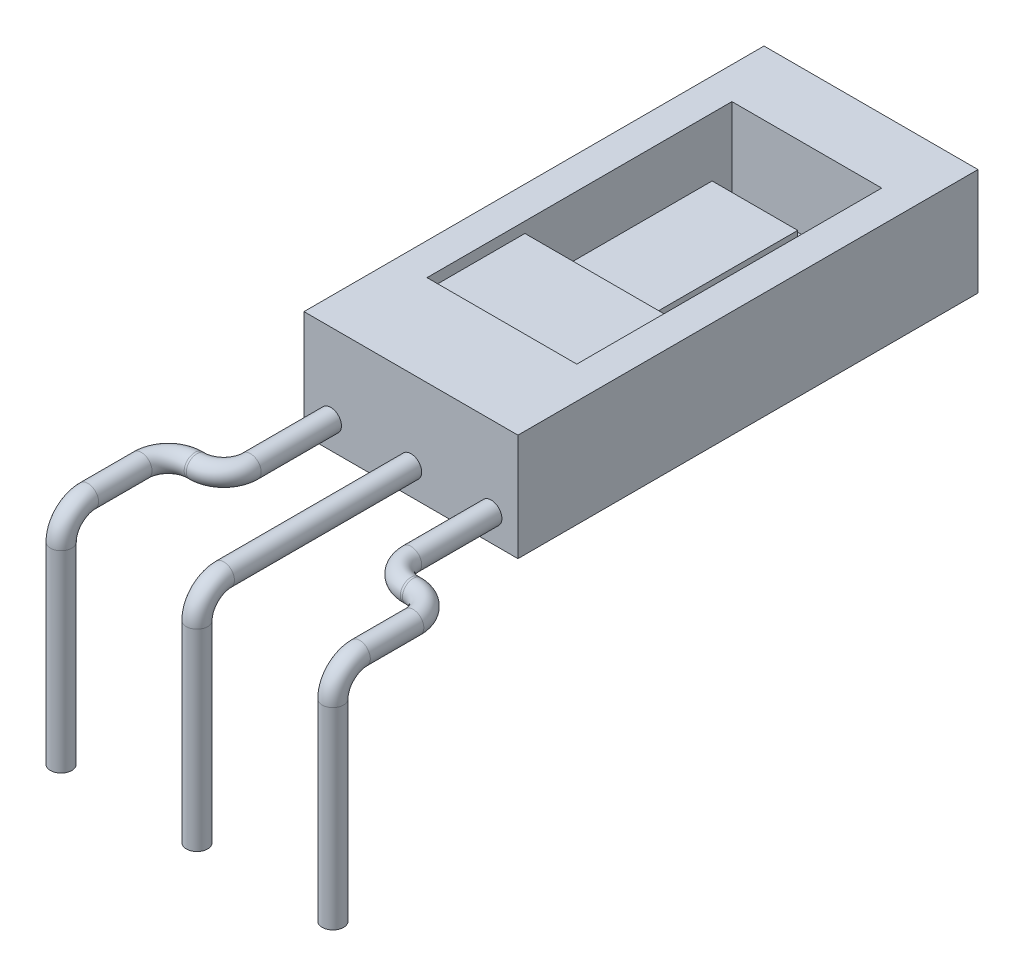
ISO-10303-21;
HEADER;
FILE_DESCRIPTION(('STEP AP214'),'2;1');
FILE_NAME('part.step','',(''),(''),'','','');
FILE_SCHEMA(('AUTOMOTIVE_DESIGN { 1 0 10303 214 1 1 1 1 }'));
ENDSEC;
DATA;
#1=APPLICATION_CONTEXT('core data for automotive mechanical design processes');
#2=APPLICATION_PROTOCOL_DEFINITION('international standard','automotive_design',2000,#1);
#3=PRODUCT_CONTEXT('',#1,'mechanical');
#4=PRODUCT('Part','Part','',(#3));
#5=PRODUCT_RELATED_PRODUCT_CATEGORY('part','',(#4));
#6=PRODUCT_DEFINITION_FORMATION('','',#4);
#7=PRODUCT_DEFINITION_CONTEXT('part definition',#1,'design');
#8=PRODUCT_DEFINITION('design','',#6,#7);
#9=PRODUCT_DEFINITION_SHAPE('','',#8);
#10=(LENGTH_UNIT() NAMED_UNIT(*) SI_UNIT(.MILLI.,.METRE.));
#11=(NAMED_UNIT(*) PLANE_ANGLE_UNIT() SI_UNIT($,.RADIAN.));
#12=(NAMED_UNIT(*) SI_UNIT($,.STERADIAN.) SOLID_ANGLE_UNIT());
#13=UNCERTAINTY_MEASURE_WITH_UNIT(LENGTH_MEASURE(1.E-05),#10,'distance_accuracy_value','');
#14=(GEOMETRIC_REPRESENTATION_CONTEXT(3) GLOBAL_UNCERTAINTY_ASSIGNED_CONTEXT((#13)) GLOBAL_UNIT_ASSIGNED_CONTEXT((#10,
#11,#12)) REPRESENTATION_CONTEXT('',''));
#15=CARTESIAN_POINT('',(0.,0.,0.));
#16=DIRECTION('',(0.,0.,1.));
#17=DIRECTION('',(1.,0.,0.));
#18=AXIS2_PLACEMENT_3D('',#15,#16,#17);
#19=CARTESIAN_POINT('',(-2.,2.,0.));
#20=DIRECTION('',(0.,0.,-1.));
#21=DIRECTION('',(-1.,0.,0.));
#22=AXIS2_PLACEMENT_3D('',#19,#20,#21);
#23=PLANE('',#22);
#24=CARTESIAN_POINT('',(1.5,0.5,0.));
#25=DIRECTION('',(0.,0.,-1.));
#26=DIRECTION('',(-1.,0.,0.));
#27=AXIS2_PLACEMENT_3D('',#24,#25,#26);
#28=CIRCLE('',#27,0.2);
#29=CARTESIAN_POINT('',(1.3,0.5,0.));
#30=VERTEX_POINT('',#29);
#31=EDGE_CURVE('E291',#30,#30,#28,.T.);
#32=ORIENTED_EDGE('',*,*,#31,.T.);
#33=EDGE_LOOP('',(#32));
#34=FACE_BOUND('',#33,.T.);
#35=CARTESIAN_POINT('',(0.,0.5,0.));
#36=DIRECTION('',(0.,0.,1.));
#37=DIRECTION('',(1.,0.,0.));
#38=AXIS2_PLACEMENT_3D('',#35,#36,#37);
#39=CIRCLE('',#38,0.2);
#40=CARTESIAN_POINT('',(0.2,0.5,0.));
#41=VERTEX_POINT('',#40);
#42=EDGE_CURVE('E36',#41,#41,#39,.T.);
#43=ORIENTED_EDGE('',*,*,#42,.F.);
#44=EDGE_LOOP('',(#43));
#45=FACE_BOUND('',#44,.T.);
#46=DIRECTION('',(1.,0.,0.));
#47=VECTOR('',#46,1.);
#48=CARTESIAN_POINT('',(-2.,0.,0.));
#49=LINE('',#48,#47);
#50=CARTESIAN_POINT('',(-2.,0.,0.));
#51=VERTEX_POINT('',#50);
#52=CARTESIAN_POINT('',(2.,0.,0.));
#53=VERTEX_POINT('',#52);
#54=EDGE_CURVE('E185',#51,#53,#49,.T.);
#55=ORIENTED_EDGE('',*,*,#54,.T.);
#56=DIRECTION('',(0.,-1.,0.));
#57=VECTOR('',#56,1.);
#58=CARTESIAN_POINT('',(2.,2.,0.));
#59=LINE('',#58,#57);
#60=CARTESIAN_POINT('',(2.,2.,0.));
#61=VERTEX_POINT('',#60);
#62=EDGE_CURVE('E159',#61,#53,#59,.T.);
#63=ORIENTED_EDGE('',*,*,#62,.F.);
#64=DIRECTION('',(1.,0.,0.));
#65=VECTOR('',#64,1.);
#66=CARTESIAN_POINT('',(-2.,2.,0.));
#67=LINE('',#66,#65);
#68=CARTESIAN_POINT('',(-2.,2.,0.));
#69=VERTEX_POINT('',#68);
#70=EDGE_CURVE('E176',#69,#61,#67,.T.);
#71=ORIENTED_EDGE('',*,*,#70,.F.);
#72=DIRECTION('',(0.,-1.,0.));
#73=VECTOR('',#72,1.);
#74=CARTESIAN_POINT('',(-2.,2.,0.));
#75=LINE('',#74,#73);
#76=EDGE_CURVE('E157',#69,#51,#75,.T.);
#77=ORIENTED_EDGE('',*,*,#76,.T.);
#78=EDGE_LOOP('',(#55,#63,#71,#77));
#79=FACE_BOUND('',#78,.T.);
#80=CARTESIAN_POINT('',(-1.5,0.5,0.));
#81=DIRECTION('',(0.,0.,1.));
#82=DIRECTION('',(1.,0.,0.));
#83=AXIS2_PLACEMENT_3D('',#80,#81,#82);
#84=CIRCLE('',#83,0.2);
#85=CARTESIAN_POINT('',(-1.3,0.5,0.));
#86=VERTEX_POINT('',#85);
#87=EDGE_CURVE('E11',#86,#86,#84,.T.);
#88=ORIENTED_EDGE('',*,*,#87,.F.);
#89=EDGE_LOOP('',(#88));
#90=FACE_BOUND('',#89,.T.);
#91=ADVANCED_FACE('F27',(#34,#45,#79,#90),#23,.F.);
#92=CARTESIAN_POINT('',(-1.4,0.5,-1.7));
#93=DIRECTION('',(0.,1.,0.));
#94=DIRECTION('',(0.,0.,1.));
#95=AXIS2_PLACEMENT_3D('',#92,#93,#94);
#96=PLANE('',#95);
#97=DIRECTION('',(1.,0.,0.));
#98=VECTOR('',#97,1.);
#99=CARTESIAN_POINT('',(-1.4,0.5,-3.53));
#100=LINE('',#99,#98);
#101=CARTESIAN_POINT('',(-1.4,0.5,-3.53));
#102=VERTEX_POINT('',#101);
#103=CARTESIAN_POINT('',(-0.8,0.5,-3.53));
#104=VERTEX_POINT('',#103);
#105=EDGE_CURVE('E31',#102,#104,#100,.T.);
#106=ORIENTED_EDGE('',*,*,#105,.T.);
#107=DIRECTION('',(0.,0.,1.));
#108=VECTOR('',#107,1.);
#109=CARTESIAN_POINT('',(-0.8,0.5,-6.43));
#110=LINE('',#109,#108);
#111=CARTESIAN_POINT('',(-0.8,0.5,-6.43));
#112=VERTEX_POINT('',#111);
#113=EDGE_CURVE('E131',#112,#104,#110,.T.);
#114=ORIENTED_EDGE('',*,*,#113,.F.);
#115=DIRECTION('',(-1.,0.,0.));
#116=VECTOR('',#115,1.);
#117=CARTESIAN_POINT('',(-0.8,0.5,-6.43));
#118=LINE('',#117,#116);
#119=CARTESIAN_POINT('',(0.800000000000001,0.5,-6.43));
#120=VERTEX_POINT('',#119);
#121=EDGE_CURVE('E238',#120,#112,#118,.T.);
#122=ORIENTED_EDGE('',*,*,#121,.F.);
#123=DIRECTION('',(0.,0.,-1.));
#124=VECTOR('',#123,1.);
#125=CARTESIAN_POINT('',(0.800000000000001,0.5,-6.43));
#126=LINE('',#125,#124);
#127=CARTESIAN_POINT('',(0.800000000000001,0.5,-3.53));
#128=VERTEX_POINT('',#127);
#129=EDGE_CURVE('E137',#128,#120,#126,.T.);
#130=ORIENTED_EDGE('',*,*,#129,.F.);
#131=CARTESIAN_POINT('',(1.4,0.5,-3.53));
#132=VERTEX_POINT('',#131);
#133=EDGE_CURVE('E52',#128,#132,#100,.T.);
#134=ORIENTED_EDGE('',*,*,#133,.T.);
#135=DIRECTION('',(0.,0.,-1.));
#136=VECTOR('',#135,1.);
#137=CARTESIAN_POINT('',(1.4,0.5,-7.4));
#138=LINE('',#137,#136);
#139=CARTESIAN_POINT('',(1.4,0.5,-7.4));
#140=VERTEX_POINT('',#139);
#141=EDGE_CURVE('E199',#132,#140,#138,.T.);
#142=ORIENTED_EDGE('',*,*,#141,.T.);
#143=DIRECTION('',(-1.,0.,0.));
#144=VECTOR('',#143,1.);
#145=CARTESIAN_POINT('',(-1.4,0.5,-7.4));
#146=LINE('',#145,#144);
#147=CARTESIAN_POINT('',(-1.4,0.5,-7.4));
#148=VERTEX_POINT('',#147);
#149=EDGE_CURVE('E193',#140,#148,#146,.T.);
#150=ORIENTED_EDGE('',*,*,#149,.T.);
#151=DIRECTION('',(0.,0.,1.));
#152=VECTOR('',#151,1.);
#153=CARTESIAN_POINT('',(-1.4,0.5,-7.4));
#154=LINE('',#153,#152);
#155=EDGE_CURVE('E154',#148,#102,#154,.T.);
#156=ORIENTED_EDGE('',*,*,#155,.T.);
#157=EDGE_LOOP('',(#106,#114,#122,#130,#134,#142,#150,#156));
#158=FACE_BOUND('',#157,.T.);
#159=ADVANCED_FACE('F151',(#158),#96,.T.);
#160=CARTESIAN_POINT('',(-1.4,1.8,-3.53));
#161=DIRECTION('',(0.,0.,1.));
#162=DIRECTION('',(1.,0.,0.));
#163=AXIS2_PLACEMENT_3D('',#160,#161,#162);
#164=PLANE('',#163);
#165=DIRECTION('',(0.,-1.,0.));
#166=VECTOR('',#165,1.);
#167=CARTESIAN_POINT('',(-0.8,1.5,-3.53));
#168=LINE('',#167,#166);
#169=CARTESIAN_POINT('',(-0.8,1.5,-3.53));
#170=VERTEX_POINT('',#169);
#171=EDGE_CURVE('E44',#170,#104,#168,.T.);
#172=ORIENTED_EDGE('',*,*,#171,.T.);
#173=ORIENTED_EDGE('',*,*,#105,.F.);
#174=DIRECTION('',(0.,-1.,0.));
#175=VECTOR('',#174,1.);
#176=CARTESIAN_POINT('',(-1.4,1.8,-3.53));
#177=LINE('',#176,#175);
#178=CARTESIAN_POINT('',(-1.4,1.8,-3.53));
#179=VERTEX_POINT('',#178);
#180=EDGE_CURVE('E219',#179,#102,#177,.T.);
#181=ORIENTED_EDGE('',*,*,#180,.F.);
#182=DIRECTION('',(-1.,0.,0.));
#183=VECTOR('',#182,1.);
#184=CARTESIAN_POINT('',(-1.4,1.8,-3.53));
#185=LINE('',#184,#183);
#186=CARTESIAN_POINT('',(1.4,1.8,-3.53));
#187=VERTEX_POINT('',#186);
#188=EDGE_CURVE('E221',#187,#179,#185,.T.);
#189=ORIENTED_EDGE('',*,*,#188,.F.);
#190=DIRECTION('',(0.,-1.,0.));
#191=VECTOR('',#190,1.);
#192=CARTESIAN_POINT('',(1.4,0.5,-3.53));
#193=LINE('',#192,#191);
#194=EDGE_CURVE('E217',#187,#132,#193,.T.);
#195=ORIENTED_EDGE('',*,*,#194,.T.);
#196=ORIENTED_EDGE('',*,*,#133,.F.);
#197=DIRECTION('',(0.,-1.,0.));
#198=VECTOR('',#197,1.);
#199=CARTESIAN_POINT('',(0.800000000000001,1.5,-3.53));
#200=LINE('',#199,#198);
#201=CARTESIAN_POINT('',(0.800000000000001,1.5,-3.53));
#202=VERTEX_POINT('',#201);
#203=EDGE_CURVE('E148',#202,#128,#200,.T.);
#204=ORIENTED_EDGE('',*,*,#203,.F.);
#205=DIRECTION('',(1.,0.,0.));
#206=VECTOR('',#205,1.);
#207=CARTESIAN_POINT('',(-0.8,1.5,-3.53));
#208=LINE('',#207,#206);
#209=EDGE_CURVE('E146',#170,#202,#208,.T.);
#210=ORIENTED_EDGE('',*,*,#209,.F.);
#211=EDGE_LOOP('',(#172,#173,#181,#189,#195,#196,#204,#210));
#212=FACE_BOUND('',#211,.T.);
#213=ADVANCED_FACE('F142',(#212),#164,.F.);
#214=CARTESIAN_POINT('',(-1.4,0.5,-7.4));
#215=DIRECTION('',(-1.,0.,0.));
#216=DIRECTION('',(0.,0.,1.));
#217=AXIS2_PLACEMENT_3D('',#214,#215,#216);
#218=PLANE('',#217);
#219=ORIENTED_EDGE('',*,*,#180,.T.);
#220=ORIENTED_EDGE('',*,*,#155,.F.);
#221=DIRECTION('',(0.,1.,0.));
#222=VECTOR('',#221,1.);
#223=CARTESIAN_POINT('',(-1.4,0.5,-7.4));
#224=LINE('',#223,#222);
#225=CARTESIAN_POINT('',(-1.4,2.,-7.4));
#226=VERTEX_POINT('',#225);
#227=EDGE_CURVE('E189',#148,#226,#224,.T.);
#228=ORIENTED_EDGE('',*,*,#227,.T.);
#229=DIRECTION('',(0.,0.,1.));
#230=VECTOR('',#229,1.);
#231=CARTESIAN_POINT('',(-1.4,2.,-7.4));
#232=LINE('',#231,#230);
#233=CARTESIAN_POINT('',(-1.4,2.,-1.7));
#234=VERTEX_POINT('',#233);
#235=EDGE_CURVE('E211',#226,#234,#232,.T.);
#236=ORIENTED_EDGE('',*,*,#235,.T.);
#237=DIRECTION('',(0.,1.,0.));
#238=VECTOR('',#237,1.);
#239=CARTESIAN_POINT('',(-1.4,0.5,-1.7));
#240=LINE('',#239,#238);
#241=CARTESIAN_POINT('',(-1.4,1.8,-1.7));
#242=VERTEX_POINT('',#241);
#243=EDGE_CURVE('E190',#242,#234,#240,.T.);
#244=ORIENTED_EDGE('',*,*,#243,.F.);
#245=DIRECTION('',(0.,0.,1.));
#246=VECTOR('',#245,1.);
#247=CARTESIAN_POINT('',(-1.4,1.8,-3.53));
#248=LINE('',#247,#246);
#249=EDGE_CURVE('E147',#179,#242,#248,.T.);
#250=ORIENTED_EDGE('',*,*,#249,.F.);
#251=EDGE_LOOP('',(#219,#220,#228,#236,#244,#250));
#252=FACE_BOUND('',#251,.T.);
#253=ADVANCED_FACE('F337',(#252),#218,.F.);
#254=CARTESIAN_POINT('',(1.4,0.5,-7.4));
#255=DIRECTION('',(1.,0.,0.));
#256=DIRECTION('',(0.,0.,-1.));
#257=AXIS2_PLACEMENT_3D('',#254,#255,#256);
#258=PLANE('',#257);
#259=ORIENTED_EDGE('',*,*,#194,.F.);
#260=DIRECTION('',(0.,0.,1.));
#261=VECTOR('',#260,1.);
#262=CARTESIAN_POINT('',(1.4,1.8,-7.4));
#263=LINE('',#262,#261);
#264=CARTESIAN_POINT('',(1.4,1.8,-1.7));
#265=VERTEX_POINT('',#264);
#266=EDGE_CURVE('E214',#187,#265,#263,.T.);
#267=ORIENTED_EDGE('',*,*,#266,.T.);
#268=DIRECTION('',(0.,1.,0.));
#269=VECTOR('',#268,1.);
#270=CARTESIAN_POINT('',(1.4,0.5,-1.7));
#271=LINE('',#270,#269);
#272=CARTESIAN_POINT('',(1.4,2.,-1.7));
#273=VERTEX_POINT('',#272);
#274=EDGE_CURVE('E192',#265,#273,#271,.T.);
#275=ORIENTED_EDGE('',*,*,#274,.T.);
#276=DIRECTION('',(0.,0.,-1.));
#277=VECTOR('',#276,1.);
#278=CARTESIAN_POINT('',(1.4,2.,-7.4));
#279=LINE('',#278,#277);
#280=CARTESIAN_POINT('',(1.4,2.,-7.4));
#281=VERTEX_POINT('',#280);
#282=EDGE_CURVE('E205',#273,#281,#279,.T.);
#283=ORIENTED_EDGE('',*,*,#282,.T.);
#284=DIRECTION('',(0.,1.,0.));
#285=VECTOR('',#284,1.);
#286=CARTESIAN_POINT('',(1.4,0.5,-7.4));
#287=LINE('',#286,#285);
#288=EDGE_CURVE('E195',#140,#281,#287,.T.);
#289=ORIENTED_EDGE('',*,*,#288,.F.);
#290=ORIENTED_EDGE('',*,*,#141,.F.);
#291=EDGE_LOOP('',(#259,#267,#275,#283,#289,#290));
#292=FACE_BOUND('',#291,.T.);
#293=ADVANCED_FACE('F340',(#292),#258,.F.);
#294=CARTESIAN_POINT('',(-2.,2.,-8.6));
#295=DIRECTION('',(1.,0.,0.));
#296=DIRECTION('',(0.,0.,-1.));
#297=AXIS2_PLACEMENT_3D('',#294,#295,#296);
#298=PLANE('',#297);
#299=DIRECTION('',(0.,0.,1.));
#300=VECTOR('',#299,1.);
#301=CARTESIAN_POINT('',(-2.,0.,-8.6));
#302=LINE('',#301,#300);
#303=CARTESIAN_POINT('',(-2.,0.,-8.6));
#304=VERTEX_POINT('',#303);
#305=EDGE_CURVE('E187',#304,#51,#302,.T.);
#306=ORIENTED_EDGE('',*,*,#305,.T.);
#307=ORIENTED_EDGE('',*,*,#76,.F.);
#308=DIRECTION('',(0.,0.,1.));
#309=VECTOR('',#308,1.);
#310=CARTESIAN_POINT('',(-2.,2.,-8.6));
#311=LINE('',#310,#309);
#312=CARTESIAN_POINT('',(-2.,2.,-8.6));
#313=VERTEX_POINT('',#312);
#314=EDGE_CURVE('E178',#313,#69,#311,.T.);
#315=ORIENTED_EDGE('',*,*,#314,.F.);
#316=DIRECTION('',(0.,-1.,0.));
#317=VECTOR('',#316,1.);
#318=CARTESIAN_POINT('',(-2.,2.,-8.6));
#319=LINE('',#318,#317);
#320=EDGE_CURVE('E169',#313,#304,#319,.T.);
#321=ORIENTED_EDGE('',*,*,#320,.T.);
#322=EDGE_LOOP('',(#306,#307,#315,#321));
#323=FACE_BOUND('',#322,.T.);
#324=ADVANCED_FACE('F29',(#323),#298,.F.);
#325=CARTESIAN_POINT('',(2.,2.,-8.6));
#326=DIRECTION('',(-1.,0.,0.));
#327=DIRECTION('',(0.,0.,1.));
#328=AXIS2_PLACEMENT_3D('',#325,#326,#327);
#329=PLANE('',#328);
#330=DIRECTION('',(0.,0.,-1.));
#331=VECTOR('',#330,1.);
#332=CARTESIAN_POINT('',(2.,0.,-8.6));
#333=LINE('',#332,#331);
#334=CARTESIAN_POINT('',(2.,0.,-8.6));
#335=VERTEX_POINT('',#334);
#336=EDGE_CURVE('E183',#53,#335,#333,.T.);
#337=ORIENTED_EDGE('',*,*,#336,.T.);
#338=DIRECTION('',(0.,-1.,0.));
#339=VECTOR('',#338,1.);
#340=CARTESIAN_POINT('',(2.,2.,-8.6));
#341=LINE('',#340,#339);
#342=CARTESIAN_POINT('',(2.,2.,-8.6));
#343=VERTEX_POINT('',#342);
#344=EDGE_CURVE('E164',#343,#335,#341,.T.);
#345=ORIENTED_EDGE('',*,*,#344,.F.);
#346=DIRECTION('',(0.,0.,-1.));
#347=VECTOR('',#346,1.);
#348=CARTESIAN_POINT('',(2.,2.,-8.6));
#349=LINE('',#348,#347);
#350=EDGE_CURVE('E174',#61,#343,#349,.T.);
#351=ORIENTED_EDGE('',*,*,#350,.F.);
#352=ORIENTED_EDGE('',*,*,#62,.T.);
#353=EDGE_LOOP('',(#337,#345,#351,#352));
#354=FACE_BOUND('',#353,.T.);
#355=ADVANCED_FACE('F320',(#354),#329,.F.);
#356=CARTESIAN_POINT('',(-2.,2.,-8.6));
#357=DIRECTION('',(0.,0.,1.));
#358=DIRECTION('',(1.,0.,0.));
#359=AXIS2_PLACEMENT_3D('',#356,#357,#358);
#360=PLANE('',#359);
#361=DIRECTION('',(-1.,0.,0.));
#362=VECTOR('',#361,1.);
#363=CARTESIAN_POINT('',(-2.,0.,-8.6));
#364=LINE('',#363,#362);
#365=EDGE_CURVE('E181',#335,#304,#364,.T.);
#366=ORIENTED_EDGE('',*,*,#365,.T.);
#367=ORIENTED_EDGE('',*,*,#320,.F.);
#368=DIRECTION('',(-1.,0.,0.));
#369=VECTOR('',#368,1.);
#370=CARTESIAN_POINT('',(-2.,2.,-8.6));
#371=LINE('',#370,#369);
#372=EDGE_CURVE('E172',#343,#313,#371,.T.);
#373=ORIENTED_EDGE('',*,*,#372,.F.);
#374=ORIENTED_EDGE('',*,*,#344,.T.);
#375=EDGE_LOOP('',(#366,#367,#373,#374));
#376=FACE_BOUND('',#375,.T.);
#377=ADVANCED_FACE('F323',(#376),#360,.F.);
#378=CARTESIAN_POINT('',(-2.,2.,0.));
#379=DIRECTION('',(0.,1.,0.));
#380=DIRECTION('',(0.,0.,1.));
#381=AXIS2_PLACEMENT_3D('',#378,#379,#380);
#382=PLANE('',#381);
#383=ORIENTED_EDGE('',*,*,#235,.F.);
#384=DIRECTION('',(-1.,0.,0.));
#385=VECTOR('',#384,1.);
#386=CARTESIAN_POINT('',(-1.4,2.,-7.4));
#387=LINE('',#386,#385);
#388=EDGE_CURVE('E202',#281,#226,#387,.T.);
#389=ORIENTED_EDGE('',*,*,#388,.F.);
#390=ORIENTED_EDGE('',*,*,#282,.F.);
#391=DIRECTION('',(1.,0.,0.));
#392=VECTOR('',#391,1.);
#393=CARTESIAN_POINT('',(-1.4,2.,-1.7));
#394=LINE('',#393,#392);
#395=EDGE_CURVE('E208',#234,#273,#394,.T.);
#396=ORIENTED_EDGE('',*,*,#395,.F.);
#397=EDGE_LOOP('',(#383,#389,#390,#396));
#398=FACE_BOUND('',#397,.T.);
#399=ORIENTED_EDGE('',*,*,#314,.T.);
#400=ORIENTED_EDGE('',*,*,#70,.T.);
#401=ORIENTED_EDGE('',*,*,#350,.T.);
#402=ORIENTED_EDGE('',*,*,#372,.T.);
#403=EDGE_LOOP('',(#399,#400,#401,#402));
#404=FACE_BOUND('',#403,.T.);
#405=ADVANCED_FACE('F327',(#398,#404),#382,.T.);
#406=CARTESIAN_POINT('',(-2.,0.,0.));
#407=DIRECTION('',(0.,1.,0.));
#408=DIRECTION('',(0.,0.,1.));
#409=AXIS2_PLACEMENT_3D('',#406,#407,#408);
#410=PLANE('',#409);
#411=ORIENTED_EDGE('',*,*,#305,.F.);
#412=ORIENTED_EDGE('',*,*,#365,.F.);
#413=ORIENTED_EDGE('',*,*,#336,.F.);
#414=ORIENTED_EDGE('',*,*,#54,.F.);
#415=EDGE_LOOP('',(#411,#412,#413,#414));
#416=FACE_BOUND('',#415,.T.);
#417=ADVANCED_FACE('F331',(#416),#410,.F.);
#418=CARTESIAN_POINT('',(-1.4,0.5,-7.4));
#419=DIRECTION('',(0.,0.,-1.));
#420=DIRECTION('',(-1.,0.,0.));
#421=AXIS2_PLACEMENT_3D('',#418,#419,#420);
#422=PLANE('',#421);
#423=ORIENTED_EDGE('',*,*,#388,.T.);
#424=ORIENTED_EDGE('',*,*,#227,.F.);
#425=ORIENTED_EDGE('',*,*,#149,.F.);
#426=ORIENTED_EDGE('',*,*,#288,.T.);
#427=EDGE_LOOP('',(#423,#424,#425,#426));
#428=FACE_BOUND('',#427,.T.);
#429=ADVANCED_FACE('F335',(#428),#422,.F.);
#430=CARTESIAN_POINT('',(-1.4,0.5,-1.7));
#431=DIRECTION('',(0.,0.,1.));
#432=DIRECTION('',(1.,0.,0.));
#433=AXIS2_PLACEMENT_3D('',#430,#431,#432);
#434=PLANE('',#433);
#435=ORIENTED_EDGE('',*,*,#274,.F.);
#436=DIRECTION('',(1.,0.,0.));
#437=VECTOR('',#436,1.);
#438=CARTESIAN_POINT('',(-1.4,1.8,-1.7));
#439=LINE('',#438,#437);
#440=EDGE_CURVE('E223',#242,#265,#439,.T.);
#441=ORIENTED_EDGE('',*,*,#440,.F.);
#442=ORIENTED_EDGE('',*,*,#243,.T.);
#443=ORIENTED_EDGE('',*,*,#395,.T.);
#444=EDGE_LOOP('',(#435,#441,#442,#443));
#445=FACE_BOUND('',#444,.T.);
#446=ADVANCED_FACE('F342',(#445),#434,.F.);
#447=CARTESIAN_POINT('',(-1.4,1.8,-1.7));
#448=DIRECTION('',(0.,1.,0.));
#449=DIRECTION('',(0.,0.,1.));
#450=AXIS2_PLACEMENT_3D('',#447,#448,#449);
#451=PLANE('',#450);
#452=ORIENTED_EDGE('',*,*,#266,.F.);
#453=ORIENTED_EDGE('',*,*,#188,.T.);
#454=ORIENTED_EDGE('',*,*,#249,.T.);
#455=ORIENTED_EDGE('',*,*,#440,.T.);
#456=EDGE_LOOP('',(#452,#453,#454,#455));
#457=FACE_BOUND('',#456,.T.);
#458=ADVANCED_FACE('F345',(#457),#451,.T.);
#459=CARTESIAN_POINT('',(-0.8,1.5,-6.43));
#460=DIRECTION('',(1.,0.,0.));
#461=DIRECTION('',(0.,0.,-1.));
#462=AXIS2_PLACEMENT_3D('',#459,#460,#461);
#463=PLANE('',#462);
#464=ORIENTED_EDGE('',*,*,#113,.T.);
#465=ORIENTED_EDGE('',*,*,#171,.F.);
#466=DIRECTION('',(0.,0.,1.));
#467=VECTOR('',#466,1.);
#468=CARTESIAN_POINT('',(-0.8,1.5,-6.43));
#469=LINE('',#468,#467);
#470=CARTESIAN_POINT('',(-0.8,1.5,-6.43));
#471=VERTEX_POINT('',#470);
#472=EDGE_CURVE('E236',#471,#170,#469,.T.);
#473=ORIENTED_EDGE('',*,*,#472,.F.);
#474=DIRECTION('',(0.,-1.,0.));
#475=VECTOR('',#474,1.);
#476=CARTESIAN_POINT('',(-0.8,1.5,-6.43));
#477=LINE('',#476,#475);
#478=EDGE_CURVE('E134',#471,#112,#477,.T.);
#479=ORIENTED_EDGE('',*,*,#478,.T.);
#480=EDGE_LOOP('',(#464,#465,#473,#479));
#481=FACE_BOUND('',#480,.T.);
#482=ADVANCED_FACE('F132',(#481),#463,.F.);
#483=CARTESIAN_POINT('',(0.800000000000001,1.5,-6.43));
#484=DIRECTION('',(-1.,0.,0.));
#485=DIRECTION('',(0.,0.,1.));
#486=AXIS2_PLACEMENT_3D('',#483,#484,#485);
#487=PLANE('',#486);
#488=ORIENTED_EDGE('',*,*,#129,.T.);
#489=DIRECTION('',(0.,-1.,0.));
#490=VECTOR('',#489,1.);
#491=CARTESIAN_POINT('',(0.800000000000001,1.5,-6.43));
#492=LINE('',#491,#490);
#493=CARTESIAN_POINT('',(0.800000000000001,1.5,-6.43));
#494=VERTEX_POINT('',#493);
#495=EDGE_CURVE('E227',#494,#120,#492,.T.);
#496=ORIENTED_EDGE('',*,*,#495,.F.);
#497=DIRECTION('',(0.,0.,-1.));
#498=VECTOR('',#497,1.);
#499=CARTESIAN_POINT('',(0.800000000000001,1.5,-6.43));
#500=LINE('',#499,#498);
#501=EDGE_CURVE('E233',#202,#494,#500,.T.);
#502=ORIENTED_EDGE('',*,*,#501,.F.);
#503=ORIENTED_EDGE('',*,*,#203,.T.);
#504=EDGE_LOOP('',(#488,#496,#502,#503));
#505=FACE_BOUND('',#504,.T.);
#506=ADVANCED_FACE('F360',(#505),#487,.F.);
#507=CARTESIAN_POINT('',(-0.8,1.5,-6.43));
#508=DIRECTION('',(0.,0.,1.));
#509=DIRECTION('',(1.,0.,0.));
#510=AXIS2_PLACEMENT_3D('',#507,#508,#509);
#511=PLANE('',#510);
#512=ORIENTED_EDGE('',*,*,#121,.T.);
#513=ORIENTED_EDGE('',*,*,#478,.F.);
#514=DIRECTION('',(-1.,0.,0.));
#515=VECTOR('',#514,1.);
#516=CARTESIAN_POINT('',(-0.8,1.5,-6.43));
#517=LINE('',#516,#515);
#518=EDGE_CURVE('E231',#494,#471,#517,.T.);
#519=ORIENTED_EDGE('',*,*,#518,.F.);
#520=ORIENTED_EDGE('',*,*,#495,.T.);
#521=EDGE_LOOP('',(#512,#513,#519,#520));
#522=FACE_BOUND('',#521,.T.);
#523=ADVANCED_FACE('F363',(#522),#511,.F.);
#524=CARTESIAN_POINT('',(-0.8,1.5,-3.53));
#525=DIRECTION('',(0.,1.,0.));
#526=DIRECTION('',(0.,0.,1.));
#527=AXIS2_PLACEMENT_3D('',#524,#525,#526);
#528=PLANE('',#527);
#529=ORIENTED_EDGE('',*,*,#472,.T.);
#530=ORIENTED_EDGE('',*,*,#209,.T.);
#531=ORIENTED_EDGE('',*,*,#501,.T.);
#532=ORIENTED_EDGE('',*,*,#518,.T.);
#533=EDGE_LOOP('',(#529,#530,#531,#532));
#534=FACE_BOUND('',#533,.T.);
#535=ADVANCED_FACE('F367',(#534),#528,.T.);
#536=CARTESIAN_POINT('',(0.,0.,4.));
#537=DIRECTION('',(0.,-1.,0.));
#538=DIRECTION('',(0.,0.,-1.));
#539=AXIS2_PLACEMENT_3D('',#536,#537,#538);
#540=CYLINDRICAL_SURFACE('',#539,0.2);
#541=CARTESIAN_POINT('',(0.,0.,4.));
#542=DIRECTION('',(0.,-1.,0.));
#543=DIRECTION('',(1.,0.,0.));
#544=AXIS2_PLACEMENT_3D('',#541,#542,#543);
#545=CIRCLE('',#544,0.2);
#546=CARTESIAN_POINT('',(0.,0.,4.2));
#547=VERTEX_POINT('',#546);
#548=EDGE_CURVE('E243',#547,#547,#545,.T.);
#549=ORIENTED_EDGE('',*,*,#548,.T.);
#550=EDGE_LOOP('',(#549));
#551=FACE_BOUND('',#550,.T.);
#552=CARTESIAN_POINT('',(0.,-3.6,4.));
#553=DIRECTION('',(0.,-1.,0.));
#554=DIRECTION('',(1.,0.,0.));
#555=AXIS2_PLACEMENT_3D('',#552,#553,#554);
#556=CIRCLE('',#555,0.2);
#557=CARTESIAN_POINT('',(0.2,-3.6,4.));
#558=VERTEX_POINT('',#557);
#559=EDGE_CURVE('E138',#558,#558,#556,.T.);
#560=ORIENTED_EDGE('',*,*,#559,.F.);
#561=EDGE_LOOP('',(#560));
#562=FACE_BOUND('',#561,.T.);
#563=ADVANCED_FACE('F371',(#551,#562),#540,.T.);
#564=CARTESIAN_POINT('',(0.,0.,3.5));
#565=DIRECTION('',(1.,0.,0.));
#566=DIRECTION('',(0.,0.,-1.));
#567=AXIS2_PLACEMENT_3D('',#564,#565,#566);
#568=TOROIDAL_SURFACE('',#567,0.5,0.2);
#569=CARTESIAN_POINT('',(0.,0.5,3.5));
#570=DIRECTION('',(0.,0.,1.));
#571=DIRECTION('',(1.,0.,0.));
#572=AXIS2_PLACEMENT_3D('',#569,#570,#571);
#573=CIRCLE('',#572,0.2);
#574=CARTESIAN_POINT('',(0.,0.7,3.5));
#575=VERTEX_POINT('',#574);
#576=EDGE_CURVE('E246',#575,#575,#573,.T.);
#577=CARTESIAN_POINT('',(0.,0.,3.5));
#578=DIRECTION('',(1.,0.,0.));
#579=DIRECTION('',(0.,0.,-1.));
#580=AXIS2_PLACEMENT_3D('',#577,#578,#579);
#581=CIRCLE('',#580,0.7);
#582=EDGE_CURVE('',#575,#547,#581,.T.);
#583=ORIENTED_EDGE('',*,*,#576,.T.);
#584=ORIENTED_EDGE('',*,*,#548,.F.);
#585=ORIENTED_EDGE('',*,*,#582,.T.);
#586=ORIENTED_EDGE('',*,*,#582,.F.);
#587=EDGE_LOOP('',(#583,#585,#584,#586));
#588=FACE_BOUND('',#587,.T.);
#589=ADVANCED_FACE('F375',(#588),#568,.T.);
#590=CARTESIAN_POINT('',(0.,0.5,3.5));
#591=DIRECTION('',(0.,0.,-1.));
#592=DIRECTION('',(-1.,0.,0.));
#593=AXIS2_PLACEMENT_3D('',#590,#591,#592);
#594=CYLINDRICAL_SURFACE('',#593,0.2);
#595=ORIENTED_EDGE('',*,*,#576,.F.);
#596=EDGE_LOOP('',(#595));
#597=FACE_BOUND('',#596,.T.);
#598=ORIENTED_EDGE('',*,*,#42,.T.);
#599=EDGE_LOOP('',(#598));
#600=FACE_BOUND('',#599,.T.);
#601=ADVANCED_FACE('F379',(#597,#600),#594,.T.);
#602=CARTESIAN_POINT('',(0.,-3.6,4.));
#603=DIRECTION('',(0.,-1.,0.));
#604=DIRECTION('',(1.,0.,0.));
#605=AXIS2_PLACEMENT_3D('',#602,#603,#604);
#606=PLANE('',#605);
#607=ORIENTED_EDGE('',*,*,#559,.T.);
#608=EDGE_LOOP('',(#607));
#609=FACE_BOUND('',#608,.T.);
#610=ADVANCED_FACE('F383',(#609),#606,.T.);
#611=CARTESIAN_POINT('',(-2.54,-1.18225741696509E-11,4.));
#612=DIRECTION('',(0.,-1.,0.));
#613=DIRECTION('',(0.,0.,-1.));
#614=AXIS2_PLACEMENT_3D('',#611,#612,#613);
#615=CYLINDRICAL_SURFACE('',#614,0.2);
#616=CARTESIAN_POINT('',(-2.54,-1.18225741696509E-11,4.));
#617=DIRECTION('',(0.,-1.,5.91156515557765E-12));
#618=DIRECTION('',(1.,0.,-5.91150392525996E-12));
#619=AXIS2_PLACEMENT_3D('',#616,#617,#618);
#620=CIRCLE('',#619,0.2);
#621=CARTESIAN_POINT('',(-2.54,-1.18222272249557E-11,4.2));
#622=VERTEX_POINT('',#621);
#623=EDGE_CURVE('E252',#622,#622,#620,.T.);
#624=ORIENTED_EDGE('',*,*,#623,.T.);
#625=EDGE_LOOP('',(#624));
#626=FACE_BOUND('',#625,.T.);
#627=CARTESIAN_POINT('',(-2.54,-3.6,4.));
#628=DIRECTION('',(0.,-1.,5.91156515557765E-12));
#629=DIRECTION('',(1.,0.,-5.91150392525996E-12));
#630=AXIS2_PLACEMENT_3D('',#627,#628,#629);
#631=CIRCLE('',#630,0.2);
#632=CARTESIAN_POINT('',(-2.34,-3.6,3.99999999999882));
#633=VERTEX_POINT('',#632);
#634=EDGE_CURVE('E248',#633,#633,#631,.T.);
#635=ORIENTED_EDGE('',*,*,#634,.F.);
#636=EDGE_LOOP('',(#635));
#637=FACE_BOUND('',#636,.T.);
#638=ADVANCED_FACE('F387',(#626,#637),#615,.T.);
#639=CARTESIAN_POINT('',(-2.54,-1.18234415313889E-11,3.5));
#640=DIRECTION('',(1.,0.,0.));
#641=DIRECTION('',(0.,0.,-1.));
#642=AXIS2_PLACEMENT_3D('',#639,#640,#641);
#643=TOROIDAL_SURFACE('',#642,0.5,0.2);
#644=CARTESIAN_POINT('',(-2.54,0.499999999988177,3.5));
#645=DIRECTION('',(0.,5.91150392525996E-12,1.));
#646=DIRECTION('',(1.,-5.91150392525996E-12,0.));
#647=AXIS2_PLACEMENT_3D('',#644,#645,#646);
#648=CIRCLE('',#647,0.2);
#649=CARTESIAN_POINT('',(-2.54,0.699999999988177,3.5));
#650=VERTEX_POINT('',#649);
#651=EDGE_CURVE('E255',#650,#650,#648,.T.);
#652=CARTESIAN_POINT('',(-2.54,-1.18234415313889E-11,3.5));
#653=DIRECTION('',(1.,0.,0.));
#654=DIRECTION('',(0.,0.,-1.));
#655=AXIS2_PLACEMENT_3D('',#652,#653,#654);
#656=CIRCLE('',#655,0.7);
#657=EDGE_CURVE('',#650,#622,#656,.T.);
#658=ORIENTED_EDGE('',*,*,#651,.T.);
#659=ORIENTED_EDGE('',*,*,#623,.F.);
#660=ORIENTED_EDGE('',*,*,#657,.T.);
#661=ORIENTED_EDGE('',*,*,#657,.F.);
#662=EDGE_LOOP('',(#658,#660,#659,#661));
#663=FACE_BOUND('',#662,.T.);
#664=ADVANCED_FACE('F391',(#663),#643,.T.);
#665=CARTESIAN_POINT('',(-2.54,0.499999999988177,2.5));
#666=DIRECTION('',(0.,0.,1.));
#667=DIRECTION('',(1.,0.,0.));
#668=AXIS2_PLACEMENT_3D('',#665,#666,#667);
#669=CYLINDRICAL_SURFACE('',#668,0.2);
#670=CARTESIAN_POINT('',(-2.54,0.499999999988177,2.5));
#671=DIRECTION('',(0.,5.91150392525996E-12,1.));
#672=DIRECTION('',(1.,-5.91150392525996E-12,0.));
#673=AXIS2_PLACEMENT_3D('',#670,#671,#672);
#674=CIRCLE('',#673,0.2);
#675=CARTESIAN_POINT('',(-2.74,0.499999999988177,2.5));
#676=VERTEX_POINT('',#675);
#677=EDGE_CURVE('E258',#676,#676,#674,.T.);
#678=ORIENTED_EDGE('',*,*,#677,.T.);
#679=EDGE_LOOP('',(#678));
#680=FACE_BOUND('',#679,.T.);
#681=ORIENTED_EDGE('',*,*,#651,.F.);
#682=EDGE_LOOP('',(#681));
#683=FACE_BOUND('',#682,.T.);
#684=ADVANCED_FACE('F395',(#680,#683),#669,.T.);
#685=CARTESIAN_POINT('',(-2.04,0.499999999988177,2.5));
#686=DIRECTION('',(0.,1.,0.));
#687=DIRECTION('',(0.,0.,1.));
#688=AXIS2_PLACEMENT_3D('',#685,#686,#687);
#689=TOROIDAL_SURFACE('',#688,0.5,0.2);
#690=CARTESIAN_POINT('',(-2.04,0.499999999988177,2.));
#691=DIRECTION('',(-1.,5.91150392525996E-12,0.));
#692=DIRECTION('',(0.,-5.91150392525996E-12,1.));
#693=AXIS2_PLACEMENT_3D('',#690,#691,#692);
#694=CIRCLE('',#693,0.2);
#695=CARTESIAN_POINT('',(-2.04,0.499999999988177,1.8));
#696=VERTEX_POINT('',#695);
#697=EDGE_CURVE('E261',#696,#696,#694,.T.);
#698=CARTESIAN_POINT('',(-2.04,0.499999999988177,2.5));
#699=DIRECTION('',(0.,1.,0.));
#700=DIRECTION('',(0.,0.,1.));
#701=AXIS2_PLACEMENT_3D('',#698,#699,#700);
#702=CIRCLE('',#701,0.7);
#703=EDGE_CURVE('',#696,#676,#702,.T.);
#704=ORIENTED_EDGE('',*,*,#697,.T.);
#705=ORIENTED_EDGE('',*,*,#677,.F.);
#706=ORIENTED_EDGE('',*,*,#703,.T.);
#707=ORIENTED_EDGE('',*,*,#703,.F.);
#708=EDGE_LOOP('',(#704,#706,#705,#707));
#709=FACE_BOUND('',#708,.T.);
#710=ADVANCED_FACE('F399',(#709),#689,.T.);
#711=CARTESIAN_POINT('',(-2.,0.499999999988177,2.));
#712=DIRECTION('',(-1.,0.,0.));
#713=DIRECTION('',(0.,0.,1.));
#714=AXIS2_PLACEMENT_3D('',#711,#712,#713);
#715=CYLINDRICAL_SURFACE('',#714,0.2);
#716=CARTESIAN_POINT('',(-2.,0.499999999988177,2.));
#717=DIRECTION('',(-1.,5.91150392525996E-12,0.));
#718=DIRECTION('',(0.,-5.91150392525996E-12,1.));
#719=AXIS2_PLACEMENT_3D('',#716,#717,#718);
#720=CIRCLE('',#719,0.2);
#721=CARTESIAN_POINT('',(-2.,0.499999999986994,2.2));
#722=VERTEX_POINT('',#721);
#723=EDGE_CURVE('E264',#722,#722,#720,.T.);
#724=ORIENTED_EDGE('',*,*,#723,.T.);
#725=EDGE_LOOP('',(#724));
#726=FACE_BOUND('',#725,.T.);
#727=ORIENTED_EDGE('',*,*,#697,.F.);
#728=EDGE_LOOP('',(#727));
#729=FACE_BOUND('',#728,.T.);
#730=ADVANCED_FACE('F403',(#726,#729),#715,.T.);
#731=CARTESIAN_POINT('',(-2.,0.499999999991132,1.5));
#732=DIRECTION('',(0.,-1.,-5.91150392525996E-12));
#733=DIRECTION('',(0.,5.91150392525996E-12,-1.));
#734=AXIS2_PLACEMENT_3D('',#731,#732,#733);
#735=TOROIDAL_SURFACE('',#734,0.5,0.2);
#736=CARTESIAN_POINT('',(-1.5,0.499999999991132,1.5));
#737=DIRECTION('',(0.,0.,1.));
#738=DIRECTION('',(1.,0.,0.));
#739=AXIS2_PLACEMENT_3D('',#736,#737,#738);
#740=CIRCLE('',#739,0.2);
#741=CARTESIAN_POINT('',(-1.3,0.499999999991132,1.5));
#742=VERTEX_POINT('',#741);
#743=EDGE_CURVE('E267',#742,#742,#740,.T.);
#744=CARTESIAN_POINT('',(-2.,0.499999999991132,1.5));
#745=DIRECTION('',(0.,-1.,-5.91150392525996E-12));
#746=DIRECTION('',(0.,5.91150392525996E-12,-1.));
#747=AXIS2_PLACEMENT_3D('',#744,#745,#746);
#748=CIRCLE('',#747,0.7);
#749=EDGE_CURVE('',#742,#722,#748,.T.);
#750=ORIENTED_EDGE('',*,*,#743,.T.);
#751=ORIENTED_EDGE('',*,*,#723,.F.);
#752=ORIENTED_EDGE('',*,*,#749,.T.);
#753=ORIENTED_EDGE('',*,*,#749,.F.);
#754=EDGE_LOOP('',(#750,#752,#751,#753));
#755=FACE_BOUND('',#754,.T.);
#756=ADVANCED_FACE('F407',(#755),#735,.T.);
#757=CARTESIAN_POINT('',(-1.5,0.499999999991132,1.5));
#758=DIRECTION('',(0.,5.91150392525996E-12,-1.));
#759=DIRECTION('',(0.,1.,5.91150392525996E-12));
#760=AXIS2_PLACEMENT_3D('',#757,#758,#759);
#761=CYLINDRICAL_SURFACE('',#760,0.2);
#762=ORIENTED_EDGE('',*,*,#743,.F.);
#763=EDGE_LOOP('',(#762));
#764=FACE_BOUND('',#763,.T.);
#765=ORIENTED_EDGE('',*,*,#87,.T.);
#766=EDGE_LOOP('',(#765));
#767=FACE_BOUND('',#766,.T.);
#768=ADVANCED_FACE('F411',(#764,#767),#761,.T.);
#769=CARTESIAN_POINT('',(-2.54,-3.6,4.));
#770=DIRECTION('',(0.,-1.,5.91156515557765E-12));
#771=DIRECTION('',(1.,0.,-5.91150392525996E-12));
#772=AXIS2_PLACEMENT_3D('',#769,#770,#771);
#773=PLANE('',#772);
#774=ORIENTED_EDGE('',*,*,#634,.T.);
#775=EDGE_LOOP('',(#774));
#776=FACE_BOUND('',#775,.T.);
#777=ADVANCED_FACE('F415',(#776),#773,.T.);
#778=CARTESIAN_POINT('',(2.54,-1.18225741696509E-11,4.));
#779=DIRECTION('',(0.,-1.,0.));
#780=DIRECTION('',(0.,0.,-1.));
#781=AXIS2_PLACEMENT_3D('',#778,#779,#780);
#782=CYLINDRICAL_SURFACE('',#781,0.2);
#783=CARTESIAN_POINT('',(2.54,-1.18225741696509E-11,4.));
#784=DIRECTION('',(0.,1.,-5.91156515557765E-12));
#785=DIRECTION('',(-1.,0.,-5.91150392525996E-12));
#786=AXIS2_PLACEMENT_3D('',#783,#784,#785);
#787=CIRCLE('',#786,0.2);
#788=CARTESIAN_POINT('',(2.54,-1.18222272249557E-11,4.2));
#789=VERTEX_POINT('',#788);
#790=EDGE_CURVE('E273',#789,#789,#787,.T.);
#791=ORIENTED_EDGE('',*,*,#790,.F.);
#792=EDGE_LOOP('',(#791));
#793=FACE_BOUND('',#792,.T.);
#794=CARTESIAN_POINT('',(2.54,-3.6,4.));
#795=DIRECTION('',(0.,1.,-5.91156515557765E-12));
#796=DIRECTION('',(-1.,0.,-5.91150392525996E-12));
#797=AXIS2_PLACEMENT_3D('',#794,#795,#796);
#798=CIRCLE('',#797,0.2);
#799=CARTESIAN_POINT('',(2.34,-3.6,3.99999999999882));
#800=VERTEX_POINT('',#799);
#801=EDGE_CURVE('E269',#800,#800,#798,.T.);
#802=ORIENTED_EDGE('',*,*,#801,.T.);
#803=EDGE_LOOP('',(#802));
#804=FACE_BOUND('',#803,.T.);
#805=ADVANCED_FACE('F418',(#793,#804),#782,.T.);
#806=CARTESIAN_POINT('',(2.54,-1.18234415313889E-11,3.5));
#807=DIRECTION('',(1.,0.,0.));
#808=DIRECTION('',(0.,0.,-1.));
#809=AXIS2_PLACEMENT_3D('',#806,#807,#808);
#810=TOROIDAL_SURFACE('',#809,0.5,0.2);
#811=CARTESIAN_POINT('',(2.54,0.499999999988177,3.5));
#812=DIRECTION('',(0.,-5.91150392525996E-12,-1.));
#813=DIRECTION('',(-1.,-5.91150392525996E-12,0.));
#814=AXIS2_PLACEMENT_3D('',#811,#812,#813);
#815=CIRCLE('',#814,0.2);
#816=CARTESIAN_POINT('',(2.54,0.699999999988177,3.5));
#817=VERTEX_POINT('',#816);
#818=EDGE_CURVE('E276',#817,#817,#815,.T.);
#819=CARTESIAN_POINT('',(2.54,-1.18234415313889E-11,3.5));
#820=DIRECTION('',(1.,0.,0.));
#821=DIRECTION('',(0.,0.,-1.));
#822=AXIS2_PLACEMENT_3D('',#819,#820,#821);
#823=CIRCLE('',#822,0.7);
#824=EDGE_CURVE('',#817,#789,#823,.T.);
#825=ORIENTED_EDGE('',*,*,#818,.F.);
#826=ORIENTED_EDGE('',*,*,#790,.T.);
#827=ORIENTED_EDGE('',*,*,#824,.T.);
#828=ORIENTED_EDGE('',*,*,#824,.F.);
#829=EDGE_LOOP('',(#825,#827,#826,#828));
#830=FACE_BOUND('',#829,.T.);
#831=ADVANCED_FACE('F421',(#830),#810,.T.);
#832=CARTESIAN_POINT('',(2.54,0.499999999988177,2.5));
#833=DIRECTION('',(0.,0.,1.));
#834=DIRECTION('',(1.,0.,0.));
#835=AXIS2_PLACEMENT_3D('',#832,#833,#834);
#836=CYLINDRICAL_SURFACE('',#835,0.2);
#837=CARTESIAN_POINT('',(2.54,0.499999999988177,2.5));
#838=DIRECTION('',(0.,-5.91150392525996E-12,-1.));
#839=DIRECTION('',(-1.,-5.91150392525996E-12,0.));
#840=AXIS2_PLACEMENT_3D('',#837,#838,#839);
#841=CIRCLE('',#840,0.2);
#842=CARTESIAN_POINT('',(2.74,0.499999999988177,2.5));
#843=VERTEX_POINT('',#842);
#844=EDGE_CURVE('E279',#843,#843,#841,.T.);
#845=ORIENTED_EDGE('',*,*,#844,.F.);
#846=EDGE_LOOP('',(#845));
#847=FACE_BOUND('',#846,.T.);
#848=ORIENTED_EDGE('',*,*,#818,.T.);
#849=EDGE_LOOP('',(#848));
#850=FACE_BOUND('',#849,.T.);
#851=ADVANCED_FACE('F425',(#847,#850),#836,.T.);
#852=CARTESIAN_POINT('',(2.04,0.499999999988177,2.5));
#853=DIRECTION('',(0.,-1.,0.));
#854=DIRECTION('',(0.,0.,-1.));
#855=AXIS2_PLACEMENT_3D('',#852,#853,#854);
#856=TOROIDAL_SURFACE('',#855,0.5,0.2);
#857=CARTESIAN_POINT('',(2.04,0.499999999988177,2.));
#858=DIRECTION('',(-1.,-5.91150392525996E-12,0.));
#859=DIRECTION('',(0.,-5.91150392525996E-12,1.));
#860=AXIS2_PLACEMENT_3D('',#857,#858,#859);
#861=CIRCLE('',#860,0.2);
#862=CARTESIAN_POINT('',(2.04,0.499999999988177,1.8));
#863=VERTEX_POINT('',#862);
#864=EDGE_CURVE('E282',#863,#863,#861,.T.);
#865=CARTESIAN_POINT('',(2.04,0.499999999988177,2.5));
#866=DIRECTION('',(0.,-1.,0.));
#867=DIRECTION('',(0.,0.,-1.));
#868=AXIS2_PLACEMENT_3D('',#865,#866,#867);
#869=CIRCLE('',#868,0.7);
#870=EDGE_CURVE('',#863,#843,#869,.T.);
#871=ORIENTED_EDGE('',*,*,#864,.F.);
#872=ORIENTED_EDGE('',*,*,#844,.T.);
#873=ORIENTED_EDGE('',*,*,#870,.T.);
#874=ORIENTED_EDGE('',*,*,#870,.F.);
#875=EDGE_LOOP('',(#871,#873,#872,#874));
#876=FACE_BOUND('',#875,.T.);
#877=ADVANCED_FACE('F429',(#876),#856,.T.);
#878=CARTESIAN_POINT('',(2.,0.499999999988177,2.));
#879=DIRECTION('',(1.,0.,0.));
#880=DIRECTION('',(0.,0.,-1.));
#881=AXIS2_PLACEMENT_3D('',#878,#879,#880);
#882=CYLINDRICAL_SURFACE('',#881,0.2);
#883=CARTESIAN_POINT('',(2.,0.499999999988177,2.));
#884=DIRECTION('',(-1.,-5.91150392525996E-12,0.));
#885=DIRECTION('',(0.,-5.91150392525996E-12,1.));
#886=AXIS2_PLACEMENT_3D('',#883,#884,#885);
#887=CIRCLE('',#886,0.2);
#888=CARTESIAN_POINT('',(2.,0.499999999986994,2.2));
#889=VERTEX_POINT('',#888);
#890=EDGE_CURVE('E285',#889,#889,#887,.T.);
#891=ORIENTED_EDGE('',*,*,#890,.F.);
#892=EDGE_LOOP('',(#891));
#893=FACE_BOUND('',#892,.T.);
#894=ORIENTED_EDGE('',*,*,#864,.T.);
#895=EDGE_LOOP('',(#894));
#896=FACE_BOUND('',#895,.T.);
#897=ADVANCED_FACE('F309',(#893,#896),#882,.T.);
#898=CARTESIAN_POINT('',(2.,0.499999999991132,1.5));
#899=DIRECTION('',(0.,1.,5.91150392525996E-12));
#900=DIRECTION('',(0.,-5.91150392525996E-12,1.));
#901=AXIS2_PLACEMENT_3D('',#898,#899,#900);
#902=TOROIDAL_SURFACE('',#901,0.5,0.2);
#903=CARTESIAN_POINT('',(1.5,0.499999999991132,1.5));
#904=DIRECTION('',(0.,0.,-1.));
#905=DIRECTION('',(-1.,0.,0.));
#906=AXIS2_PLACEMENT_3D('',#903,#904,#905);
#907=CIRCLE('',#906,0.2);
#908=CARTESIAN_POINT('',(1.3,0.499999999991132,1.5));
#909=VERTEX_POINT('',#908);
#910=EDGE_CURVE('E288',#909,#909,#907,.T.);
#911=CARTESIAN_POINT('',(2.,0.499999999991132,1.5));
#912=DIRECTION('',(0.,1.,5.91150392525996E-12));
#913=DIRECTION('',(0.,-5.91150392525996E-12,1.));
#914=AXIS2_PLACEMENT_3D('',#911,#912,#913);
#915=CIRCLE('',#914,0.7);
#916=EDGE_CURVE('',#909,#889,#915,.T.);
#917=ORIENTED_EDGE('',*,*,#910,.F.);
#918=ORIENTED_EDGE('',*,*,#890,.T.);
#919=ORIENTED_EDGE('',*,*,#916,.T.);
#920=ORIENTED_EDGE('',*,*,#916,.F.);
#921=EDGE_LOOP('',(#917,#919,#918,#920));
#922=FACE_BOUND('',#921,.T.);
#923=ADVANCED_FACE('F300',(#922),#902,.T.);
#924=CARTESIAN_POINT('',(1.5,0.499999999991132,1.5));
#925=DIRECTION('',(0.,5.91150392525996E-12,-1.));
#926=DIRECTION('',(0.,1.,5.91150392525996E-12));
#927=AXIS2_PLACEMENT_3D('',#924,#925,#926);
#928=CYLINDRICAL_SURFACE('',#927,0.2);
#929=ORIENTED_EDGE('',*,*,#910,.T.);
#930=EDGE_LOOP('',(#929));
#931=FACE_BOUND('',#930,.T.);
#932=ORIENTED_EDGE('',*,*,#31,.F.);
#933=EDGE_LOOP('',(#932));
#934=FACE_BOUND('',#933,.T.);
#935=ADVANCED_FACE('F297',(#931,#934),#928,.T.);
#936=CARTESIAN_POINT('',(2.54,-3.6,4.));
#937=DIRECTION('',(0.,-1.,5.91156515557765E-12));
#938=DIRECTION('',(-1.,0.,-5.91150392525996E-12));
#939=AXIS2_PLACEMENT_3D('',#936,#937,#938);
#940=PLANE('',#939);
#941=ORIENTED_EDGE('',*,*,#801,.F.);
#942=EDGE_LOOP('',(#941));
#943=FACE_BOUND('',#942,.T.);
#944=ADVANCED_FACE('F299',(#943),#940,.T.);
#945=CLOSED_SHELL('',(#91,#159,#213,#253,#293,#324,#355,#377,#405,#417,#429,#446,#458,#482,#506,
#523,#535,#563,#589,#601,#610,#638,#664,#684,#710,#730,#756,#768,#777,#805,#831,#851,#877,#897,
#923,#935,#944));
#946=MANIFOLD_SOLID_BREP('B2',#945);
#947=ADVANCED_BREP_SHAPE_REPRESENTATION('',(#18,#946),#14);
#948=SHAPE_DEFINITION_REPRESENTATION(#9,#947);
ENDSEC;
END-ISO-10303-21;
